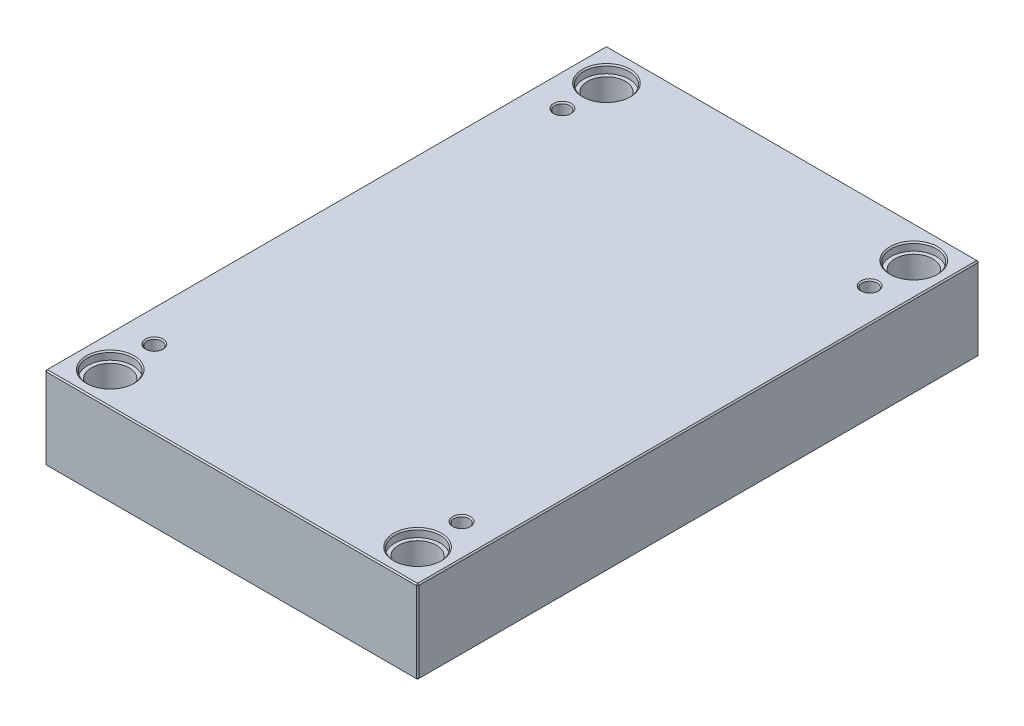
ISO-10303-21;
HEADER;
FILE_DESCRIPTION(('STEP AP214'),'2;1');
FILE_NAME('part.step','',(''),(''),'','','');
FILE_SCHEMA(('AUTOMOTIVE_DESIGN { 1 0 10303 214 1 1 1 1 }'));
ENDSEC;
DATA;
#1=APPLICATION_CONTEXT('core data for automotive mechanical design processes');
#2=APPLICATION_PROTOCOL_DEFINITION('international standard','automotive_design',2000,#1);
#3=PRODUCT_CONTEXT('',#1,'mechanical');
#4=PRODUCT('Part','Part','',(#3));
#5=PRODUCT_RELATED_PRODUCT_CATEGORY('part','',(#4));
#6=PRODUCT_DEFINITION_FORMATION('','',#4);
#7=PRODUCT_DEFINITION_CONTEXT('part definition',#1,'design');
#8=PRODUCT_DEFINITION('design','',#6,#7);
#9=PRODUCT_DEFINITION_SHAPE('','',#8);
#10=(LENGTH_UNIT() NAMED_UNIT(*) SI_UNIT(.MILLI.,.METRE.));
#11=(NAMED_UNIT(*) PLANE_ANGLE_UNIT() SI_UNIT($,.RADIAN.));
#12=(NAMED_UNIT(*) SI_UNIT($,.STERADIAN.) SOLID_ANGLE_UNIT());
#13=UNCERTAINTY_MEASURE_WITH_UNIT(LENGTH_MEASURE(1.E-05),#10,'distance_accuracy_value','');
#14=(GEOMETRIC_REPRESENTATION_CONTEXT(3) GLOBAL_UNCERTAINTY_ASSIGNED_CONTEXT((#13)) GLOBAL_UNIT_ASSIGNED_CONTEXT((#10,
#11,#12)) REPRESENTATION_CONTEXT('',''));
#15=CARTESIAN_POINT('',(0.,0.,0.));
#16=DIRECTION('',(0.,0.,1.));
#17=DIRECTION('',(1.,0.,0.));
#18=AXIS2_PLACEMENT_3D('',#15,#16,#17);
#19=CARTESIAN_POINT('',(-122.,0.,-197.));
#20=DIRECTION('',(0.,1.,0.));
#21=DIRECTION('',(0.,0.,1.));
#22=AXIS2_PLACEMENT_3D('',#19,#20,#21);
#23=CYLINDRICAL_SURFACE('',#22,15.);
#24=CARTESIAN_POINT('',(-122.,1.00000000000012,-197.));
#25=DIRECTION('',(0.,1.,0.));
#26=DIRECTION('',(0.,0.,1.));
#27=AXIS2_PLACEMENT_3D('',#24,#25,#26);
#28=CIRCLE('',#27,15.);
#29=CARTESIAN_POINT('',(-122.,1.00000000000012,-182.));
#30=VERTEX_POINT('',#29);
#31=EDGE_CURVE('E472',#30,#30,#28,.F.);
#32=ORIENTED_EDGE('',*,*,#31,.T.);
#33=EDGE_LOOP('',(#32));
#34=FACE_BOUND('',#33,.T.);
#35=CARTESIAN_POINT('',(-122.,59.7,-197.));
#36=DIRECTION('',(0.,1.,0.));
#37=DIRECTION('',(0.,0.,1.));
#38=AXIS2_PLACEMENT_3D('',#35,#36,#37);
#39=CIRCLE('',#38,15.);
#40=CARTESIAN_POINT('',(-122.,59.7,-182.));
#41=VERTEX_POINT('',#40);
#42=EDGE_CURVE('E221',#41,#41,#39,.F.);
#43=ORIENTED_EDGE('',*,*,#42,.F.);
#44=EDGE_LOOP('',(#43));
#45=FACE_BOUND('',#44,.T.);
#46=ADVANCED_FACE('F16',(#34,#45),#23,.F.);
#47=CARTESIAN_POINT('',(122.,0.,-197.));
#48=DIRECTION('',(0.,1.,0.));
#49=DIRECTION('',(0.,0.,1.));
#50=AXIS2_PLACEMENT_3D('',#47,#48,#49);
#51=CYLINDRICAL_SURFACE('',#50,15.);
#52=CARTESIAN_POINT('',(122.,1.,-197.));
#53=DIRECTION('',(0.,1.,0.));
#54=DIRECTION('',(0.,0.,1.));
#55=AXIS2_PLACEMENT_3D('',#52,#53,#54);
#56=CIRCLE('',#55,15.);
#57=CARTESIAN_POINT('',(122.,1.,-182.));
#58=VERTEX_POINT('',#57);
#59=EDGE_CURVE('E474',#58,#58,#56,.F.);
#60=ORIENTED_EDGE('',*,*,#59,.T.);
#61=EDGE_LOOP('',(#60));
#62=FACE_BOUND('',#61,.T.);
#63=CARTESIAN_POINT('',(122.,59.7,-197.));
#64=DIRECTION('',(0.,1.,0.));
#65=DIRECTION('',(0.,0.,1.));
#66=AXIS2_PLACEMENT_3D('',#63,#64,#65);
#67=CIRCLE('',#66,15.);
#68=CARTESIAN_POINT('',(122.,59.7,-182.));
#69=VERTEX_POINT('',#68);
#70=EDGE_CURVE('E218',#69,#69,#67,.F.);
#71=ORIENTED_EDGE('',*,*,#70,.F.);
#72=EDGE_LOOP('',(#71));
#73=FACE_BOUND('',#72,.T.);
#74=ADVANCED_FACE('F263',(#62,#73),#51,.F.);
#75=CARTESIAN_POINT('',(122.,0.,197.));
#76=DIRECTION('',(0.,1.,0.));
#77=DIRECTION('',(0.,0.,1.));
#78=AXIS2_PLACEMENT_3D('',#75,#76,#77);
#79=CYLINDRICAL_SURFACE('',#78,15.);
#80=CARTESIAN_POINT('',(122.,1.,197.));
#81=DIRECTION('',(0.,1.,0.));
#82=DIRECTION('',(0.,0.,1.));
#83=AXIS2_PLACEMENT_3D('',#80,#81,#82);
#84=CIRCLE('',#83,15.);
#85=CARTESIAN_POINT('',(122.,1.,212.));
#86=VERTEX_POINT('',#85);
#87=EDGE_CURVE('E477',#86,#86,#84,.F.);
#88=ORIENTED_EDGE('',*,*,#87,.T.);
#89=EDGE_LOOP('',(#88));
#90=FACE_BOUND('',#89,.T.);
#91=CARTESIAN_POINT('',(122.,59.7,197.));
#92=DIRECTION('',(0.,1.,0.));
#93=DIRECTION('',(0.,0.,1.));
#94=AXIS2_PLACEMENT_3D('',#91,#92,#93);
#95=CIRCLE('',#94,15.);
#96=CARTESIAN_POINT('',(122.,59.7,212.));
#97=VERTEX_POINT('',#96);
#98=EDGE_CURVE('E214',#97,#97,#95,.F.);
#99=ORIENTED_EDGE('',*,*,#98,.F.);
#100=EDGE_LOOP('',(#99));
#101=FACE_BOUND('',#100,.T.);
#102=ADVANCED_FACE('F270',(#90,#101),#79,.F.);
#103=CARTESIAN_POINT('',(-122.,0.,197.));
#104=DIRECTION('',(0.,1.,0.));
#105=DIRECTION('',(0.,0.,1.));
#106=AXIS2_PLACEMENT_3D('',#103,#104,#105);
#107=CYLINDRICAL_SURFACE('',#106,15.);
#108=CARTESIAN_POINT('',(-122.,1.00000000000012,197.));
#109=DIRECTION('',(0.,1.,0.));
#110=DIRECTION('',(0.,0.,1.));
#111=AXIS2_PLACEMENT_3D('',#108,#109,#110);
#112=CIRCLE('',#111,15.);
#113=CARTESIAN_POINT('',(-122.,1.00000000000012,212.));
#114=VERTEX_POINT('',#113);
#115=EDGE_CURVE('E480',#114,#114,#112,.F.);
#116=ORIENTED_EDGE('',*,*,#115,.T.);
#117=EDGE_LOOP('',(#116));
#118=FACE_BOUND('',#117,.T.);
#119=CARTESIAN_POINT('',(-122.,59.7,197.));
#120=DIRECTION('',(0.,1.,0.));
#121=DIRECTION('',(0.,0.,1.));
#122=AXIS2_PLACEMENT_3D('',#119,#120,#121);
#123=CIRCLE('',#122,15.);
#124=CARTESIAN_POINT('',(-122.,59.7,212.));
#125=VERTEX_POINT('',#124);
#126=EDGE_CURVE('E211',#125,#125,#123,.F.);
#127=ORIENTED_EDGE('',*,*,#126,.F.);
#128=EDGE_LOOP('',(#127));
#129=FACE_BOUND('',#128,.T.);
#130=ADVANCED_FACE('F277',(#118,#129),#107,.F.);
#131=CARTESIAN_POINT('',(-148.,66.,223.));
#132=DIRECTION('',(1.,0.,0.));
#133=DIRECTION('',(0.,0.,-1.));
#134=AXIS2_PLACEMENT_3D('',#131,#132,#133);
#135=PLANE('',#134);
#136=DIRECTION('',(0.,-1.,0.));
#137=VECTOR('',#136,1.);
#138=CARTESIAN_POINT('',(-148.,66.,-222.));
#139=LINE('',#138,#137);
#140=CARTESIAN_POINT('',(-148.,65.,-222.));
#141=VERTEX_POINT('',#140);
#142=CARTESIAN_POINT('',(-148.,1.,-222.));
#143=VERTEX_POINT('',#142);
#144=EDGE_CURVE('E487',#141,#143,#139,.T.);
#145=ORIENTED_EDGE('',*,*,#144,.T.);
#146=DIRECTION('',(0.,0.,1.));
#147=VECTOR('',#146,1.);
#148=CARTESIAN_POINT('',(-148.,1.,223.));
#149=LINE('',#148,#147);
#150=CARTESIAN_POINT('',(-148.,1.,222.));
#151=VERTEX_POINT('',#150);
#152=EDGE_CURVE('E490',#143,#151,#149,.T.);
#153=ORIENTED_EDGE('',*,*,#152,.T.);
#154=DIRECTION('',(0.,1.,0.));
#155=VECTOR('',#154,1.);
#156=CARTESIAN_POINT('',(-148.,66.,222.));
#157=LINE('',#156,#155);
#158=CARTESIAN_POINT('',(-148.,65.,222.));
#159=VERTEX_POINT('',#158);
#160=EDGE_CURVE('E485',#151,#159,#157,.T.);
#161=ORIENTED_EDGE('',*,*,#160,.T.);
#162=DIRECTION('',(0.,0.,-1.));
#163=VECTOR('',#162,1.);
#164=CARTESIAN_POINT('',(-148.,65.,-223.));
#165=LINE('',#164,#163);
#166=EDGE_CURVE('E483',#159,#141,#165,.T.);
#167=ORIENTED_EDGE('',*,*,#166,.T.);
#168=EDGE_LOOP('',(#145,#153,#161,#167));
#169=FACE_BOUND('',#168,.T.);
#170=ADVANCED_FACE('F298',(#169),#135,.F.);
#171=CARTESIAN_POINT('',(148.,66.,223.));
#172=DIRECTION('',(0.,0.,-1.));
#173=DIRECTION('',(-1.,0.,0.));
#174=AXIS2_PLACEMENT_3D('',#171,#172,#173);
#175=PLANE('',#174);
#176=DIRECTION('',(-1.,0.,0.));
#177=VECTOR('',#176,1.);
#178=CARTESIAN_POINT('',(-148.,65.,223.));
#179=LINE('',#178,#177);
#180=CARTESIAN_POINT('',(147.,65.,223.));
#181=VERTEX_POINT('',#180);
#182=CARTESIAN_POINT('',(-147.,65.,223.));
#183=VERTEX_POINT('',#182);
#184=EDGE_CURVE('E509',#181,#183,#179,.T.);
#185=ORIENTED_EDGE('',*,*,#184,.T.);
#186=DIRECTION('',(0.,-1.,0.));
#187=VECTOR('',#186,1.);
#188=CARTESIAN_POINT('',(-147.,66.,223.));
#189=LINE('',#188,#187);
#190=CARTESIAN_POINT('',(-147.,0.999999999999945,223.));
#191=VERTEX_POINT('',#190);
#192=EDGE_CURVE('E515',#183,#191,#189,.T.);
#193=ORIENTED_EDGE('',*,*,#192,.T.);
#194=DIRECTION('',(1.,0.,0.));
#195=VECTOR('',#194,1.);
#196=CARTESIAN_POINT('',(148.,0.999999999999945,223.));
#197=LINE('',#196,#195);
#198=CARTESIAN_POINT('',(147.,0.999999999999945,223.));
#199=VERTEX_POINT('',#198);
#200=EDGE_CURVE('E513',#191,#199,#197,.T.);
#201=ORIENTED_EDGE('',*,*,#200,.T.);
#202=DIRECTION('',(0.,1.,0.));
#203=VECTOR('',#202,1.);
#204=CARTESIAN_POINT('',(147.,66.,223.));
#205=LINE('',#204,#203);
#206=EDGE_CURVE('E511',#199,#181,#205,.T.);
#207=ORIENTED_EDGE('',*,*,#206,.T.);
#208=EDGE_LOOP('',(#185,#193,#201,#207));
#209=FACE_BOUND('',#208,.T.);
#210=ADVANCED_FACE('F294',(#209),#175,.F.);
#211=CARTESIAN_POINT('',(148.,66.,223.));
#212=DIRECTION('',(-1.,0.,0.));
#213=DIRECTION('',(0.,0.,1.));
#214=AXIS2_PLACEMENT_3D('',#211,#212,#213);
#215=PLANE('',#214);
#216=DIRECTION('',(0.,0.,-1.));
#217=VECTOR('',#216,1.);
#218=CARTESIAN_POINT('',(148.,0.999999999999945,223.));
#219=LINE('',#218,#217);
#220=CARTESIAN_POINT('',(148.,0.999999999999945,222.));
#221=VERTEX_POINT('',#220);
#222=CARTESIAN_POINT('',(148.,0.999999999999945,-222.));
#223=VERTEX_POINT('',#222);
#224=EDGE_CURVE('E504',#221,#223,#219,.T.);
#225=ORIENTED_EDGE('',*,*,#224,.T.);
#226=DIRECTION('',(0.,1.,0.));
#227=VECTOR('',#226,1.);
#228=CARTESIAN_POINT('',(148.,66.,-222.));
#229=LINE('',#228,#227);
#230=CARTESIAN_POINT('',(148.,65.,-222.));
#231=VERTEX_POINT('',#230);
#232=EDGE_CURVE('E506',#223,#231,#229,.T.);
#233=ORIENTED_EDGE('',*,*,#232,.T.);
#234=DIRECTION('',(0.,0.,1.));
#235=VECTOR('',#234,1.);
#236=CARTESIAN_POINT('',(148.,65.,223.));
#237=LINE('',#236,#235);
#238=CARTESIAN_POINT('',(148.,65.,222.));
#239=VERTEX_POINT('',#238);
#240=EDGE_CURVE('E500',#231,#239,#237,.T.);
#241=ORIENTED_EDGE('',*,*,#240,.T.);
#242=DIRECTION('',(0.,-1.,0.));
#243=VECTOR('',#242,1.);
#244=CARTESIAN_POINT('',(148.,66.,222.));
#245=LINE('',#244,#243);
#246=EDGE_CURVE('E502',#239,#221,#245,.T.);
#247=ORIENTED_EDGE('',*,*,#246,.T.);
#248=EDGE_LOOP('',(#225,#233,#241,#247));
#249=FACE_BOUND('',#248,.T.);
#250=ADVANCED_FACE('F290',(#249),#215,.F.);
#251=CARTESIAN_POINT('',(148.,66.,-223.));
#252=DIRECTION('',(0.,0.,1.));
#253=DIRECTION('',(1.,0.,0.));
#254=AXIS2_PLACEMENT_3D('',#251,#252,#253);
#255=PLANE('',#254);
#256=DIRECTION('',(0.,-1.,0.));
#257=VECTOR('',#256,1.);
#258=CARTESIAN_POINT('',(147.,66.,-223.));
#259=LINE('',#258,#257);
#260=CARTESIAN_POINT('',(147.,65.,-223.));
#261=VERTEX_POINT('',#260);
#262=CARTESIAN_POINT('',(147.,0.999999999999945,-223.));
#263=VERTEX_POINT('',#262);
#264=EDGE_CURVE('E494',#261,#263,#259,.T.);
#265=ORIENTED_EDGE('',*,*,#264,.T.);
#266=DIRECTION('',(-1.,0.,0.));
#267=VECTOR('',#266,1.);
#268=CARTESIAN_POINT('',(148.,0.999999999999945,-223.));
#269=LINE('',#268,#267);
#270=CARTESIAN_POINT('',(-147.,0.999999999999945,-223.));
#271=VERTEX_POINT('',#270);
#272=EDGE_CURVE('E138',#263,#271,#269,.T.);
#273=ORIENTED_EDGE('',*,*,#272,.T.);
#274=DIRECTION('',(0.,1.,0.));
#275=VECTOR('',#274,1.);
#276=CARTESIAN_POINT('',(-147.,66.,-223.));
#277=LINE('',#276,#275);
#278=CARTESIAN_POINT('',(-147.,65.,-223.));
#279=VERTEX_POINT('',#278);
#280=EDGE_CURVE('E496',#271,#279,#277,.T.);
#281=ORIENTED_EDGE('',*,*,#280,.T.);
#282=DIRECTION('',(1.,0.,0.));
#283=VECTOR('',#282,1.);
#284=CARTESIAN_POINT('',(148.,65.,-223.));
#285=LINE('',#284,#283);
#286=EDGE_CURVE('E492',#279,#261,#285,.T.);
#287=ORIENTED_EDGE('',*,*,#286,.T.);
#288=EDGE_LOOP('',(#265,#273,#281,#287));
#289=FACE_BOUND('',#288,.T.);
#290=ADVANCED_FACE('F282',(#289),#255,.F.);
#291=CARTESIAN_POINT('',(0.,66.,0.));
#292=DIRECTION('',(0.,1.,0.));
#293=DIRECTION('',(0.,0.,1.));
#294=AXIS2_PLACEMENT_3D('',#291,#292,#293);
#295=PLANE('',#294);
#296=CARTESIAN_POINT('',(122.,66.,197.));
#297=DIRECTION('',(0.,1.,0.));
#298=DIRECTION('',(0.,0.,1.));
#299=AXIS2_PLACEMENT_3D('',#296,#297,#298);
#300=CIRCLE('',#299,19.);
#301=CARTESIAN_POINT('',(122.,66.,216.));
#302=VERTEX_POINT('',#301);
#303=EDGE_CURVE('E236',#302,#302,#300,.F.);
#304=ORIENTED_EDGE('',*,*,#303,.T.);
#305=EDGE_LOOP('',(#304));
#306=FACE_BOUND('',#305,.T.);
#307=CARTESIAN_POINT('',(-122.,66.,197.));
#308=DIRECTION('',(0.,1.,0.));
#309=DIRECTION('',(0.,0.,1.));
#310=AXIS2_PLACEMENT_3D('',#307,#308,#309);
#311=CIRCLE('',#310,19.);
#312=CARTESIAN_POINT('',(-122.,66.,216.));
#313=VERTEX_POINT('',#312);
#314=EDGE_CURVE('E233',#313,#313,#311,.F.);
#315=ORIENTED_EDGE('',*,*,#314,.T.);
#316=EDGE_LOOP('',(#315));
#317=FACE_BOUND('',#316,.T.);
#318=CARTESIAN_POINT('',(122.,66.,-197.));
#319=DIRECTION('',(0.,1.,0.));
#320=DIRECTION('',(0.,0.,1.));
#321=AXIS2_PLACEMENT_3D('',#318,#319,#320);
#322=CIRCLE('',#321,19.);
#323=CARTESIAN_POINT('',(122.,66.,-178.));
#324=VERTEX_POINT('',#323);
#325=EDGE_CURVE('E230',#324,#324,#322,.F.);
#326=ORIENTED_EDGE('',*,*,#325,.T.);
#327=EDGE_LOOP('',(#326));
#328=FACE_BOUND('',#327,.T.);
#329=CARTESIAN_POINT('',(-122.,66.,-197.));
#330=DIRECTION('',(0.,1.,0.));
#331=DIRECTION('',(0.,0.,1.));
#332=AXIS2_PLACEMENT_3D('',#329,#330,#331);
#333=CIRCLE('',#332,19.);
#334=CARTESIAN_POINT('',(-122.,66.,-178.));
#335=VERTEX_POINT('',#334);
#336=EDGE_CURVE('E227',#335,#335,#333,.F.);
#337=ORIENTED_EDGE('',*,*,#336,.T.);
#338=EDGE_LOOP('',(#337));
#339=FACE_BOUND('',#338,.T.);
#340=CARTESIAN_POINT('',(-122.,66.,162.));
#341=DIRECTION('',(0.,1.,0.));
#342=DIRECTION('',(0.,0.,1.));
#343=AXIS2_PLACEMENT_3D('',#340,#341,#342);
#344=CIRCLE('',#343,7.);
#345=CARTESIAN_POINT('',(-122.,66.,169.));
#346=VERTEX_POINT('',#345);
#347=EDGE_CURVE('E198',#346,#346,#344,.F.);
#348=ORIENTED_EDGE('',*,*,#347,.T.);
#349=EDGE_LOOP('',(#348));
#350=FACE_BOUND('',#349,.T.);
#351=CARTESIAN_POINT('',(122.,66.,162.));
#352=DIRECTION('',(0.,1.,0.));
#353=DIRECTION('',(0.,0.,1.));
#354=AXIS2_PLACEMENT_3D('',#351,#352,#353);
#355=CIRCLE('',#354,7.);
#356=CARTESIAN_POINT('',(122.,66.,169.));
#357=VERTEX_POINT('',#356);
#358=EDGE_CURVE('E195',#357,#357,#355,.F.);
#359=ORIENTED_EDGE('',*,*,#358,.T.);
#360=EDGE_LOOP('',(#359));
#361=FACE_BOUND('',#360,.T.);
#362=CARTESIAN_POINT('',(122.,66.,-162.));
#363=DIRECTION('',(0.,1.,0.));
#364=DIRECTION('',(0.,0.,1.));
#365=AXIS2_PLACEMENT_3D('',#362,#363,#364);
#366=CIRCLE('',#365,7.);
#367=CARTESIAN_POINT('',(122.,66.,-155.));
#368=VERTEX_POINT('',#367);
#369=EDGE_CURVE('E192',#368,#368,#366,.F.);
#370=ORIENTED_EDGE('',*,*,#369,.T.);
#371=EDGE_LOOP('',(#370));
#372=FACE_BOUND('',#371,.T.);
#373=CARTESIAN_POINT('',(-122.,66.,-162.));
#374=DIRECTION('',(0.,1.,0.));
#375=DIRECTION('',(0.,0.,1.));
#376=AXIS2_PLACEMENT_3D('',#373,#374,#375);
#377=CIRCLE('',#376,7.);
#378=CARTESIAN_POINT('',(-122.,66.,-155.));
#379=VERTEX_POINT('',#378);
#380=EDGE_CURVE('E188',#379,#379,#377,.F.);
#381=ORIENTED_EDGE('',*,*,#380,.T.);
#382=EDGE_LOOP('',(#381));
#383=FACE_BOUND('',#382,.T.);
#384=DIRECTION('',(0.,0.,-1.));
#385=VECTOR('',#384,1.);
#386=CARTESIAN_POINT('',(147.,66.,-223.));
#387=LINE('',#386,#385);
#388=CARTESIAN_POINT('',(147.,66.,222.));
#389=VERTEX_POINT('',#388);
#390=CARTESIAN_POINT('',(147.,66.,-222.));
#391=VERTEX_POINT('',#390);
#392=EDGE_CURVE('E31',#389,#391,#387,.T.);
#393=ORIENTED_EDGE('',*,*,#392,.T.);
#394=DIRECTION('',(-1.,0.,0.));
#395=VECTOR('',#394,1.);
#396=CARTESIAN_POINT('',(-148.,66.,-222.));
#397=LINE('',#396,#395);
#398=CARTESIAN_POINT('',(-147.,66.,-222.));
#399=VERTEX_POINT('',#398);
#400=EDGE_CURVE('E189',#391,#399,#397,.T.);
#401=ORIENTED_EDGE('',*,*,#400,.T.);
#402=DIRECTION('',(0.,0.,1.));
#403=VECTOR('',#402,1.);
#404=CARTESIAN_POINT('',(-147.,66.,223.));
#405=LINE('',#404,#403);
#406=CARTESIAN_POINT('',(-147.,66.,222.));
#407=VERTEX_POINT('',#406);
#408=EDGE_CURVE('E518',#399,#407,#405,.T.);
#409=ORIENTED_EDGE('',*,*,#408,.T.);
#410=DIRECTION('',(1.,0.,0.));
#411=VECTOR('',#410,1.);
#412=CARTESIAN_POINT('',(148.,66.,222.));
#413=LINE('',#412,#411);
#414=EDGE_CURVE('E36',#407,#389,#413,.T.);
#415=ORIENTED_EDGE('',*,*,#414,.T.);
#416=EDGE_LOOP('',(#393,#401,#409,#415));
#417=FACE_BOUND('',#416,.T.);
#418=ADVANCED_FACE('F279',(#306,#317,#328,#339,#350,#361,#372,#383,#417),#295,.T.);
#419=CARTESIAN_POINT('',(0.,0.,0.));
#420=DIRECTION('',(0.,1.,0.));
#421=DIRECTION('',(0.,0.,1.));
#422=AXIS2_PLACEMENT_3D('',#419,#420,#421);
#423=PLANE('',#422);
#424=CARTESIAN_POINT('',(-122.,0.,-197.));
#425=DIRECTION('',(0.,1.,0.));
#426=DIRECTION('',(0.,0.,1.));
#427=AXIS2_PLACEMENT_3D('',#424,#425,#426);
#428=CIRCLE('',#427,16.);
#429=CARTESIAN_POINT('',(-122.,0.,-181.));
#430=VERTEX_POINT('',#429);
#431=EDGE_CURVE('E469',#430,#430,#428,.T.);
#432=ORIENTED_EDGE('',*,*,#431,.T.);
#433=EDGE_LOOP('',(#432));
#434=FACE_BOUND('',#433,.T.);
#435=CARTESIAN_POINT('',(122.,0.,-197.));
#436=DIRECTION('',(0.,1.,0.));
#437=DIRECTION('',(0.,0.,1.));
#438=AXIS2_PLACEMENT_3D('',#435,#436,#437);
#439=CIRCLE('',#438,16.);
#440=CARTESIAN_POINT('',(122.,0.,-181.));
#441=VERTEX_POINT('',#440);
#442=EDGE_CURVE('E466',#441,#441,#439,.T.);
#443=ORIENTED_EDGE('',*,*,#442,.T.);
#444=EDGE_LOOP('',(#443));
#445=FACE_BOUND('',#444,.T.);
#446=CARTESIAN_POINT('',(122.,0.,197.));
#447=DIRECTION('',(0.,1.,0.));
#448=DIRECTION('',(0.,0.,1.));
#449=AXIS2_PLACEMENT_3D('',#446,#447,#448);
#450=CIRCLE('',#449,16.);
#451=CARTESIAN_POINT('',(122.,0.,213.));
#452=VERTEX_POINT('',#451);
#453=EDGE_CURVE('E463',#452,#452,#450,.T.);
#454=ORIENTED_EDGE('',*,*,#453,.T.);
#455=EDGE_LOOP('',(#454));
#456=FACE_BOUND('',#455,.T.);
#457=CARTESIAN_POINT('',(-122.,0.,197.));
#458=DIRECTION('',(0.,1.,0.));
#459=DIRECTION('',(0.,0.,1.));
#460=AXIS2_PLACEMENT_3D('',#457,#458,#459);
#461=CIRCLE('',#460,16.);
#462=CARTESIAN_POINT('',(-122.,0.,213.));
#463=VERTEX_POINT('',#462);
#464=EDGE_CURVE('E460',#463,#463,#461,.T.);
#465=ORIENTED_EDGE('',*,*,#464,.T.);
#466=EDGE_LOOP('',(#465));
#467=FACE_BOUND('',#466,.T.);
#468=DIRECTION('',(0.,0.,1.));
#469=VECTOR('',#468,1.);
#470=CARTESIAN_POINT('',(147.,0.,0.));
#471=LINE('',#470,#469);
#472=CARTESIAN_POINT('',(147.,0.,-222.));
#473=VERTEX_POINT('',#472);
#474=CARTESIAN_POINT('',(147.,0.,222.));
#475=VERTEX_POINT('',#474);
#476=EDGE_CURVE('E108',#473,#475,#471,.T.);
#477=ORIENTED_EDGE('',*,*,#476,.T.);
#478=DIRECTION('',(-1.,0.,0.));
#479=VECTOR('',#478,1.);
#480=CARTESIAN_POINT('',(0.,0.,222.));
#481=LINE('',#480,#479);
#482=CARTESIAN_POINT('',(-147.,0.,222.));
#483=VERTEX_POINT('',#482);
#484=EDGE_CURVE('E458',#475,#483,#481,.T.);
#485=ORIENTED_EDGE('',*,*,#484,.T.);
#486=DIRECTION('',(0.,0.,-1.));
#487=VECTOR('',#486,1.);
#488=CARTESIAN_POINT('',(-147.,0.,0.));
#489=LINE('',#488,#487);
#490=CARTESIAN_POINT('',(-147.,0.,-222.));
#491=VERTEX_POINT('',#490);
#492=EDGE_CURVE('E110',#483,#491,#489,.T.);
#493=ORIENTED_EDGE('',*,*,#492,.T.);
#494=DIRECTION('',(1.,0.,0.));
#495=VECTOR('',#494,1.);
#496=CARTESIAN_POINT('',(0.,0.,-222.));
#497=LINE('',#496,#495);
#498=EDGE_CURVE('E104',#491,#473,#497,.T.);
#499=ORIENTED_EDGE('',*,*,#498,.T.);
#500=EDGE_LOOP('',(#477,#485,#493,#499));
#501=FACE_BOUND('',#500,.T.);
#502=ADVANCED_FACE('F106',(#434,#445,#456,#467,#501),#423,.F.);
#503=CARTESIAN_POINT('',(-122.,0.,-197.));
#504=DIRECTION('',(0.,-1.,0.));
#505=DIRECTION('',(0.,0.,-1.));
#506=AXIS2_PLACEMENT_3D('',#503,#504,#505);
#507=CONICAL_SURFACE('',#506,16.,0.78539816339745);
#508=ORIENTED_EDGE('',*,*,#31,.F.);
#509=EDGE_LOOP('',(#508));
#510=FACE_BOUND('',#509,.T.);
#511=ORIENTED_EDGE('',*,*,#431,.F.);
#512=EDGE_LOOP('',(#511));
#513=FACE_BOUND('',#512,.T.);
#514=ADVANCED_FACE('F286',(#510,#513),#507,.F.);
#515=CARTESIAN_POINT('',(122.,0.,-197.));
#516=DIRECTION('',(0.,-1.,0.));
#517=DIRECTION('',(0.,0.,-1.));
#518=AXIS2_PLACEMENT_3D('',#515,#516,#517);
#519=CONICAL_SURFACE('',#518,16.,0.785398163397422);
#520=ORIENTED_EDGE('',*,*,#59,.F.);
#521=EDGE_LOOP('',(#520));
#522=FACE_BOUND('',#521,.T.);
#523=ORIENTED_EDGE('',*,*,#442,.F.);
#524=EDGE_LOOP('',(#523));
#525=FACE_BOUND('',#524,.T.);
#526=ADVANCED_FACE('F305',(#522,#525),#519,.F.);
#527=CARTESIAN_POINT('',(122.,0.,197.));
#528=DIRECTION('',(0.,-1.,0.));
#529=DIRECTION('',(0.,0.,-1.));
#530=AXIS2_PLACEMENT_3D('',#527,#528,#529);
#531=CONICAL_SURFACE('',#530,16.,0.785398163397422);
#532=ORIENTED_EDGE('',*,*,#87,.F.);
#533=EDGE_LOOP('',(#532));
#534=FACE_BOUND('',#533,.T.);
#535=ORIENTED_EDGE('',*,*,#453,.F.);
#536=EDGE_LOOP('',(#535));
#537=FACE_BOUND('',#536,.T.);
#538=ADVANCED_FACE('F309',(#534,#537),#531,.F.);
#539=CARTESIAN_POINT('',(-122.,0.,197.));
#540=DIRECTION('',(0.,-1.,0.));
#541=DIRECTION('',(0.,0.,-1.));
#542=AXIS2_PLACEMENT_3D('',#539,#540,#541);
#543=CONICAL_SURFACE('',#542,16.,0.78539816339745);
#544=ORIENTED_EDGE('',*,*,#115,.F.);
#545=EDGE_LOOP('',(#544));
#546=FACE_BOUND('',#545,.T.);
#547=ORIENTED_EDGE('',*,*,#464,.F.);
#548=EDGE_LOOP('',(#547));
#549=FACE_BOUND('',#548,.T.);
#550=ADVANCED_FACE('F313',(#546,#549),#543,.F.);
#551=CARTESIAN_POINT('',(148.,66.,222.));
#552=DIRECTION('',(-0.707106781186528,0.,-0.707106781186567));
#553=DIRECTION('',(0.,-1.,0.));
#554=AXIS2_PLACEMENT_3D('',#551,#552,#553);
#555=PLANE('',#554);
#556=DIRECTION('',(-0.707106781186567,0.,0.707106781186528));
#557=VECTOR('',#556,1.);
#558=CARTESIAN_POINT('',(147.,65.,223.));
#559=LINE('',#558,#557);
#560=EDGE_CURVE('E126',#181,#239,#559,.F.);
#561=ORIENTED_EDGE('',*,*,#560,.F.);
#562=ORIENTED_EDGE('',*,*,#206,.F.);
#563=DIRECTION('',(0.707106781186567,0.,-0.707106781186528));
#564=VECTOR('',#563,1.);
#565=CARTESIAN_POINT('',(147.,0.999999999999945,223.));
#566=LINE('',#565,#564);
#567=EDGE_CURVE('E180',#221,#199,#566,.F.);
#568=ORIENTED_EDGE('',*,*,#567,.F.);
#569=ORIENTED_EDGE('',*,*,#246,.F.);
#570=EDGE_LOOP('',(#561,#562,#568,#569));
#571=FACE_BOUND('',#570,.T.);
#572=ADVANCED_FACE('F317',(#571),#555,.F.);
#573=CARTESIAN_POINT('',(147.,65.,223.));
#574=DIRECTION('',(0.577350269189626,0.577350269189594,0.577350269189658));
#575=DIRECTION('',(0.707106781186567,0.,-0.707106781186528));
#576=AXIS2_PLACEMENT_3D('',#573,#574,#575);
#577=PLANE('',#576);
#578=DIRECTION('',(0.,-0.707106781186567,0.707106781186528));
#579=VECTOR('',#578,1.);
#580=CARTESIAN_POINT('',(147.,65.,223.));
#581=LINE('',#580,#579);
#582=EDGE_CURVE('E175',#181,#389,#581,.F.);
#583=ORIENTED_EDGE('',*,*,#582,.F.);
#584=ORIENTED_EDGE('',*,*,#560,.T.);
#585=DIRECTION('',(-0.707106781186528,0.707106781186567,0.));
#586=VECTOR('',#585,1.);
#587=CARTESIAN_POINT('',(147.5,65.5,222.));
#588=LINE('',#587,#586);
#589=EDGE_CURVE('E177',#389,#239,#588,.F.);
#590=ORIENTED_EDGE('',*,*,#589,.F.);
#591=EDGE_LOOP('',(#583,#584,#590));
#592=FACE_BOUND('',#591,.T.);
#593=ADVANCED_FACE('F385',(#592),#577,.T.);
#594=CARTESIAN_POINT('',(147.,0.999999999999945,223.));
#595=DIRECTION('',(0.577350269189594,-0.577350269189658,0.577350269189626));
#596=DIRECTION('',(0.,-0.707106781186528,-0.707106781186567));
#597=AXIS2_PLACEMENT_3D('',#594,#595,#596);
#598=PLANE('',#597);
#599=DIRECTION('',(-0.707106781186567,-0.707106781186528,0.));
#600=VECTOR('',#599,1.);
#601=CARTESIAN_POINT('',(147.5,0.499999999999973,222.));
#602=LINE('',#601,#600);
#603=EDGE_CURVE('E124',#221,#475,#602,.T.);
#604=ORIENTED_EDGE('',*,*,#603,.F.);
#605=ORIENTED_EDGE('',*,*,#567,.T.);
#606=DIRECTION('',(0.,0.707106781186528,0.707106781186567));
#607=VECTOR('',#606,1.);
#608=CARTESIAN_POINT('',(147.,0.999999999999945,223.));
#609=LINE('',#608,#607);
#610=EDGE_CURVE('E172',#475,#199,#609,.T.);
#611=ORIENTED_EDGE('',*,*,#610,.F.);
#612=EDGE_LOOP('',(#604,#605,#611));
#613=FACE_BOUND('',#612,.T.);
#614=ADVANCED_FACE('F381',(#613),#598,.T.);
#615=CARTESIAN_POINT('',(147.,66.,0.));
#616=DIRECTION('',(0.707106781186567,0.707106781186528,0.));
#617=DIRECTION('',(0.,0.,1.));
#618=AXIS2_PLACEMENT_3D('',#615,#616,#617);
#619=PLANE('',#618);
#620=ORIENTED_EDGE('',*,*,#589,.T.);
#621=ORIENTED_EDGE('',*,*,#240,.F.);
#622=DIRECTION('',(0.707106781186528,-0.707106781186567,0.));
#623=VECTOR('',#622,1.);
#624=CARTESIAN_POINT('',(148.,65.,-222.));
#625=LINE('',#624,#623);
#626=EDGE_CURVE('E166',#391,#231,#625,.T.);
#627=ORIENTED_EDGE('',*,*,#626,.F.);
#628=ORIENTED_EDGE('',*,*,#392,.F.);
#629=EDGE_LOOP('',(#620,#621,#627,#628));
#630=FACE_BOUND('',#629,.T.);
#631=ADVANCED_FACE('F377',(#630),#619,.T.);
#632=CARTESIAN_POINT('',(0.,66.,222.));
#633=DIRECTION('',(0.,0.707106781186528,0.707106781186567));
#634=DIRECTION('',(-1.,0.,0.));
#635=AXIS2_PLACEMENT_3D('',#632,#633,#634);
#636=PLANE('',#635);
#637=ORIENTED_EDGE('',*,*,#582,.T.);
#638=ORIENTED_EDGE('',*,*,#414,.F.);
#639=DIRECTION('',(0.,0.707106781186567,-0.707106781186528));
#640=VECTOR('',#639,1.);
#641=CARTESIAN_POINT('',(-147.,65.5,222.5));
#642=LINE('',#641,#640);
#643=EDGE_CURVE('E163',#183,#407,#642,.T.);
#644=ORIENTED_EDGE('',*,*,#643,.F.);
#645=ORIENTED_EDGE('',*,*,#184,.F.);
#646=EDGE_LOOP('',(#637,#638,#644,#645));
#647=FACE_BOUND('',#646,.T.);
#648=ADVANCED_FACE('F373',(#647),#636,.T.);
#649=CARTESIAN_POINT('',(-147.,66.,223.));
#650=DIRECTION('',(0.707106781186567,0.,-0.707106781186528));
#651=DIRECTION('',(0.,-1.,0.));
#652=AXIS2_PLACEMENT_3D('',#649,#650,#651);
#653=PLANE('',#652);
#654=DIRECTION('',(0.707106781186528,0.,0.707106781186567));
#655=VECTOR('',#654,1.);
#656=CARTESIAN_POINT('',(-147.,0.999999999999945,223.));
#657=LINE('',#656,#655);
#658=EDGE_CURVE('E157',#191,#151,#657,.F.);
#659=ORIENTED_EDGE('',*,*,#658,.F.);
#660=ORIENTED_EDGE('',*,*,#192,.F.);
#661=DIRECTION('',(-0.707106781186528,0.,-0.707106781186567));
#662=VECTOR('',#661,1.);
#663=CARTESIAN_POINT('',(-148.,65.,222.));
#664=LINE('',#663,#662);
#665=EDGE_CURVE('E160',#159,#183,#664,.F.);
#666=ORIENTED_EDGE('',*,*,#665,.F.);
#667=ORIENTED_EDGE('',*,*,#160,.F.);
#668=EDGE_LOOP('',(#659,#660,#666,#667));
#669=FACE_BOUND('',#668,.T.);
#670=ADVANCED_FACE('F369',(#669),#653,.F.);
#671=CARTESIAN_POINT('',(148.,0.999999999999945,223.));
#672=DIRECTION('',(0.,0.707106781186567,-0.707106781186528));
#673=DIRECTION('',(1.,0.,0.));
#674=AXIS2_PLACEMENT_3D('',#671,#672,#673);
#675=PLANE('',#674);
#676=ORIENTED_EDGE('',*,*,#610,.T.);
#677=ORIENTED_EDGE('',*,*,#200,.F.);
#678=DIRECTION('',(0.,-0.707106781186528,-0.707106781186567));
#679=VECTOR('',#678,1.);
#680=CARTESIAN_POINT('',(-147.,0.999999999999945,223.));
#681=LINE('',#680,#679);
#682=EDGE_CURVE('E135',#483,#191,#681,.F.);
#683=ORIENTED_EDGE('',*,*,#682,.F.);
#684=ORIENTED_EDGE('',*,*,#484,.F.);
#685=EDGE_LOOP('',(#676,#677,#683,#684));
#686=FACE_BOUND('',#685,.T.);
#687=ADVANCED_FACE('F366',(#686),#675,.F.);
#688=CARTESIAN_POINT('',(148.,0.999999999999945,223.));
#689=DIRECTION('',(-0.707106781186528,0.707106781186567,0.));
#690=DIRECTION('',(0.,0.,-1.));
#691=AXIS2_PLACEMENT_3D('',#688,#689,#690);
#692=PLANE('',#691);
#693=ORIENTED_EDGE('',*,*,#603,.T.);
#694=ORIENTED_EDGE('',*,*,#476,.F.);
#695=DIRECTION('',(0.707106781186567,0.707106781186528,0.));
#696=VECTOR('',#695,1.);
#697=CARTESIAN_POINT('',(147.5,0.499999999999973,-222.));
#698=LINE('',#697,#696);
#699=EDGE_CURVE('E121',#223,#473,#698,.F.);
#700=ORIENTED_EDGE('',*,*,#699,.F.);
#701=ORIENTED_EDGE('',*,*,#224,.F.);
#702=EDGE_LOOP('',(#693,#694,#700,#701));
#703=FACE_BOUND('',#702,.T.);
#704=ADVANCED_FACE('F119',(#703),#692,.F.);
#705=CARTESIAN_POINT('',(147.,66.,-223.));
#706=DIRECTION('',(-0.707106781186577,0.,0.707106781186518));
#707=DIRECTION('',(0.,-1.,0.));
#708=AXIS2_PLACEMENT_3D('',#705,#706,#707);
#709=PLANE('',#708);
#710=DIRECTION('',(0.707106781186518,0.,0.707106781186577));
#711=VECTOR('',#710,1.);
#712=CARTESIAN_POINT('',(148.,65.,-222.));
#713=LINE('',#712,#711);
#714=EDGE_CURVE('E168',#231,#261,#713,.F.);
#715=ORIENTED_EDGE('',*,*,#714,.F.);
#716=ORIENTED_EDGE('',*,*,#232,.F.);
#717=DIRECTION('',(-0.707106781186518,0.,-0.707106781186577));
#718=VECTOR('',#717,1.);
#719=CARTESIAN_POINT('',(147.,0.999999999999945,-223.));
#720=LINE('',#719,#718);
#721=EDGE_CURVE('E134',#263,#223,#720,.F.);
#722=ORIENTED_EDGE('',*,*,#721,.F.);
#723=ORIENTED_EDGE('',*,*,#264,.F.);
#724=EDGE_LOOP('',(#715,#716,#722,#723));
#725=FACE_BOUND('',#724,.T.);
#726=ADVANCED_FACE('F359',(#725),#709,.F.);
#727=CARTESIAN_POINT('',(148.,65.,-222.));
#728=DIRECTION('',(0.577350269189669,0.577350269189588,-0.57735026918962));
#729=DIRECTION('',(-0.707106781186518,0.,-0.707106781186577));
#730=AXIS2_PLACEMENT_3D('',#727,#728,#729);
#731=PLANE('',#730);
#732=ORIENTED_EDGE('',*,*,#626,.T.);
#733=ORIENTED_EDGE('',*,*,#714,.T.);
#734=DIRECTION('',(0.,0.707106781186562,0.707106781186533));
#735=VECTOR('',#734,1.);
#736=CARTESIAN_POINT('',(147.,65.5,-222.5));
#737=LINE('',#736,#735);
#738=EDGE_CURVE('E152',#391,#261,#737,.F.);
#739=ORIENTED_EDGE('',*,*,#738,.F.);
#740=EDGE_LOOP('',(#732,#733,#739));
#741=FACE_BOUND('',#740,.T.);
#742=ADVANCED_FACE('F355',(#741),#731,.T.);
#743=CARTESIAN_POINT('',(-148.,65.,222.));
#744=DIRECTION('',(-0.577350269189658,0.577350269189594,0.577350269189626));
#745=DIRECTION('',(0.707106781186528,0.,0.707106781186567));
#746=AXIS2_PLACEMENT_3D('',#743,#744,#745);
#747=PLANE('',#746);
#748=ORIENTED_EDGE('',*,*,#665,.T.);
#749=ORIENTED_EDGE('',*,*,#643,.T.);
#750=DIRECTION('',(-0.707106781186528,-0.707106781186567,0.));
#751=VECTOR('',#750,1.);
#752=CARTESIAN_POINT('',(-148.,65.,222.));
#753=LINE('',#752,#751);
#754=EDGE_CURVE('E143',#159,#407,#753,.F.);
#755=ORIENTED_EDGE('',*,*,#754,.F.);
#756=EDGE_LOOP('',(#748,#749,#755));
#757=FACE_BOUND('',#756,.T.);
#758=ADVANCED_FACE('F351',(#757),#747,.T.);
#759=CARTESIAN_POINT('',(-147.,0.999999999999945,223.));
#760=DIRECTION('',(-0.577350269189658,-0.577350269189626,0.577350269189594));
#761=DIRECTION('',(0.707106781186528,-0.707106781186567,0.));
#762=AXIS2_PLACEMENT_3D('',#759,#760,#761);
#763=PLANE('',#762);
#764=ORIENTED_EDGE('',*,*,#682,.T.);
#765=ORIENTED_EDGE('',*,*,#658,.T.);
#766=DIRECTION('',(-0.707106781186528,0.707106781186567,0.));
#767=VECTOR('',#766,1.);
#768=CARTESIAN_POINT('',(-147.5,0.5,222.));
#769=LINE('',#768,#767);
#770=EDGE_CURVE('E139',#483,#151,#769,.T.);
#771=ORIENTED_EDGE('',*,*,#770,.F.);
#772=EDGE_LOOP('',(#764,#765,#771));
#773=FACE_BOUND('',#772,.T.);
#774=ADVANCED_FACE('F348',(#773),#763,.T.);
#775=CARTESIAN_POINT('',(147.,0.999999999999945,-223.));
#776=DIRECTION('',(0.577350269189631,-0.577350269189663,-0.577350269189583));
#777=DIRECTION('',(0.707106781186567,0.707106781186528,0.));
#778=AXIS2_PLACEMENT_3D('',#775,#776,#777);
#779=PLANE('',#778);
#780=ORIENTED_EDGE('',*,*,#721,.T.);
#781=ORIENTED_EDGE('',*,*,#699,.T.);
#782=DIRECTION('',(0.,-0.707106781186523,0.707106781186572));
#783=VECTOR('',#782,1.);
#784=CARTESIAN_POINT('',(147.,0.999999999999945,-223.));
#785=LINE('',#784,#783);
#786=EDGE_CURVE('E131',#263,#473,#785,.T.);
#787=ORIENTED_EDGE('',*,*,#786,.F.);
#788=EDGE_LOOP('',(#780,#781,#787));
#789=FACE_BOUND('',#788,.T.);
#790=ADVANCED_FACE('F130',(#789),#779,.T.);
#791=CARTESIAN_POINT('',(0.,66.,-222.));
#792=DIRECTION('',(0.,0.707106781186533,-0.707106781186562));
#793=DIRECTION('',(1.,0.,0.));
#794=AXIS2_PLACEMENT_3D('',#791,#792,#793);
#795=PLANE('',#794);
#796=ORIENTED_EDGE('',*,*,#738,.T.);
#797=ORIENTED_EDGE('',*,*,#286,.F.);
#798=DIRECTION('',(0.,-0.707106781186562,-0.707106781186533));
#799=VECTOR('',#798,1.);
#800=CARTESIAN_POINT('',(-147.,65.,-223.));
#801=LINE('',#800,#799);
#802=EDGE_CURVE('E140',#399,#279,#801,.T.);
#803=ORIENTED_EDGE('',*,*,#802,.F.);
#804=ORIENTED_EDGE('',*,*,#400,.F.);
#805=EDGE_LOOP('',(#796,#797,#803,#804));
#806=FACE_BOUND('',#805,.T.);
#807=ADVANCED_FACE('F341',(#806),#795,.T.);
#808=CARTESIAN_POINT('',(-147.,66.,0.));
#809=DIRECTION('',(-0.707106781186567,0.707106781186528,0.));
#810=DIRECTION('',(0.,0.,-1.));
#811=AXIS2_PLACEMENT_3D('',#808,#809,#810);
#812=PLANE('',#811);
#813=ORIENTED_EDGE('',*,*,#754,.T.);
#814=ORIENTED_EDGE('',*,*,#408,.F.);
#815=DIRECTION('',(0.707106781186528,0.707106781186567,0.));
#816=VECTOR('',#815,1.);
#817=CARTESIAN_POINT('',(-147.5,65.5,-222.));
#818=LINE('',#817,#816);
#819=EDGE_CURVE('E146',#141,#399,#818,.T.);
#820=ORIENTED_EDGE('',*,*,#819,.F.);
#821=ORIENTED_EDGE('',*,*,#166,.F.);
#822=EDGE_LOOP('',(#813,#814,#820,#821));
#823=FACE_BOUND('',#822,.T.);
#824=ADVANCED_FACE('F337',(#823),#812,.T.);
#825=CARTESIAN_POINT('',(-148.,1.,223.));
#826=DIRECTION('',(0.707106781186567,0.707106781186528,0.));
#827=DIRECTION('',(0.,0.,1.));
#828=AXIS2_PLACEMENT_3D('',#825,#826,#827);
#829=PLANE('',#828);
#830=ORIENTED_EDGE('',*,*,#770,.T.);
#831=ORIENTED_EDGE('',*,*,#152,.F.);
#832=DIRECTION('',(0.707106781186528,-0.707106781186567,0.));
#833=VECTOR('',#832,1.);
#834=CARTESIAN_POINT('',(-148.,1.,-222.));
#835=LINE('',#834,#833);
#836=EDGE_CURVE('E529',#491,#143,#835,.F.);
#837=ORIENTED_EDGE('',*,*,#836,.F.);
#838=ORIENTED_EDGE('',*,*,#492,.F.);
#839=EDGE_LOOP('',(#830,#831,#837,#838));
#840=FACE_BOUND('',#839,.T.);
#841=ADVANCED_FACE('F334',(#840),#829,.F.);
#842=CARTESIAN_POINT('',(148.,0.999999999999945,-223.));
#843=DIRECTION('',(0.,0.707106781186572,0.707106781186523));
#844=DIRECTION('',(-1.,0.,0.));
#845=AXIS2_PLACEMENT_3D('',#842,#843,#844);
#846=PLANE('',#845);
#847=ORIENTED_EDGE('',*,*,#786,.T.);
#848=ORIENTED_EDGE('',*,*,#498,.F.);
#849=DIRECTION('',(0.,0.707106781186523,-0.707106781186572));
#850=VECTOR('',#849,1.);
#851=CARTESIAN_POINT('',(-147.,0.500000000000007,-222.5));
#852=LINE('',#851,#850);
#853=EDGE_CURVE('E526',#271,#491,#852,.F.);
#854=ORIENTED_EDGE('',*,*,#853,.F.);
#855=ORIENTED_EDGE('',*,*,#272,.F.);
#856=EDGE_LOOP('',(#847,#848,#854,#855));
#857=FACE_BOUND('',#856,.T.);
#858=ADVANCED_FACE('F137',(#857),#846,.F.);
#859=CARTESIAN_POINT('',(-147.,65.,-223.));
#860=DIRECTION('',(-0.577350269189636,0.577350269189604,-0.577350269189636));
#861=DIRECTION('',(-0.707106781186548,0.,0.707106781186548));
#862=AXIS2_PLACEMENT_3D('',#859,#860,#861);
#863=PLANE('',#862);
#864=ORIENTED_EDGE('',*,*,#819,.T.);
#865=ORIENTED_EDGE('',*,*,#802,.T.);
#866=DIRECTION('',(0.707106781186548,0.,-0.707106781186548));
#867=VECTOR('',#866,1.);
#868=CARTESIAN_POINT('',(-147.,65.,-223.));
#869=LINE('',#868,#867);
#870=EDGE_CURVE('E524',#141,#279,#869,.T.);
#871=ORIENTED_EDGE('',*,*,#870,.F.);
#872=EDGE_LOOP('',(#864,#865,#871));
#873=FACE_BOUND('',#872,.T.);
#874=ADVANCED_FACE('F327',(#873),#863,.T.);
#875=CARTESIAN_POINT('',(-148.,1.,-222.));
#876=DIRECTION('',(-0.577350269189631,-0.577350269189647,-0.577350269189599));
#877=DIRECTION('',(0.707106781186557,-0.707106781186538,0.));
#878=AXIS2_PLACEMENT_3D('',#875,#876,#877);
#879=PLANE('',#878);
#880=ORIENTED_EDGE('',*,*,#853,.T.);
#881=ORIENTED_EDGE('',*,*,#836,.T.);
#882=DIRECTION('',(-0.707106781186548,0.,0.707106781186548));
#883=VECTOR('',#882,1.);
#884=CARTESIAN_POINT('',(-148.,1.,-222.));
#885=LINE('',#884,#883);
#886=EDGE_CURVE('E455',#271,#143,#885,.T.);
#887=ORIENTED_EDGE('',*,*,#886,.F.);
#888=EDGE_LOOP('',(#880,#881,#887));
#889=FACE_BOUND('',#888,.T.);
#890=ADVANCED_FACE('F323',(#889),#879,.T.);
#891=CARTESIAN_POINT('',(-148.,66.,-222.));
#892=DIRECTION('',(0.707106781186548,0.,0.707106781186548));
#893=DIRECTION('',(0.,-1.,0.));
#894=AXIS2_PLACEMENT_3D('',#891,#892,#893);
#895=PLANE('',#894);
#896=ORIENTED_EDGE('',*,*,#870,.T.);
#897=ORIENTED_EDGE('',*,*,#280,.F.);
#898=ORIENTED_EDGE('',*,*,#886,.T.);
#899=ORIENTED_EDGE('',*,*,#144,.F.);
#900=EDGE_LOOP('',(#896,#897,#898,#899));
#901=FACE_BOUND('',#900,.T.);
#902=ADVANCED_FACE('F319',(#901),#895,.F.);
#903=CARTESIAN_POINT('',(-122.,42.,-162.));
#904=DIRECTION('',(0.,1.,0.));
#905=DIRECTION('',(0.,0.,1.));
#906=AXIS2_PLACEMENT_3D('',#903,#904,#905);
#907=CYLINDRICAL_SURFACE('',#906,6.);
#908=CARTESIAN_POINT('',(-122.,65.,-162.));
#909=DIRECTION('',(0.,1.,0.));
#910=DIRECTION('',(0.,0.,1.));
#911=AXIS2_PLACEMENT_3D('',#908,#909,#910);
#912=CIRCLE('',#911,6.);
#913=CARTESIAN_POINT('',(-122.,65.,-156.));
#914=VERTEX_POINT('',#913);
#915=EDGE_CURVE('E207',#914,#914,#912,.T.);
#916=ORIENTED_EDGE('',*,*,#915,.T.);
#917=EDGE_LOOP('',(#916));
#918=FACE_BOUND('',#917,.T.);
#919=CARTESIAN_POINT('',(-122.,42.,-162.));
#920=DIRECTION('',(0.,1.,0.));
#921=DIRECTION('',(0.,0.,1.));
#922=AXIS2_PLACEMENT_3D('',#919,#920,#921);
#923=CIRCLE('',#922,6.);
#924=CARTESIAN_POINT('',(-122.,42.,-156.));
#925=VERTEX_POINT('',#924);
#926=EDGE_CURVE('E448',#925,#925,#923,.T.);
#927=ORIENTED_EDGE('',*,*,#926,.F.);
#928=EDGE_LOOP('',(#927));
#929=FACE_BOUND('',#928,.T.);
#930=ADVANCED_FACE('F322',(#918,#929),#907,.F.);
#931=CARTESIAN_POINT('',(-122.,42.,-162.));
#932=DIRECTION('',(0.,1.,0.));
#933=DIRECTION('',(0.,0.,1.));
#934=AXIS2_PLACEMENT_3D('',#931,#932,#933);
#935=PLANE('',#934);
#936=ORIENTED_EDGE('',*,*,#926,.T.);
#937=EDGE_LOOP('',(#936));
#938=FACE_BOUND('',#937,.T.);
#939=ADVANCED_FACE('F596',(#938),#935,.T.);
#940=CARTESIAN_POINT('',(122.,42.,-162.));
#941=DIRECTION('',(0.,1.,0.));
#942=DIRECTION('',(0.,0.,1.));
#943=AXIS2_PLACEMENT_3D('',#940,#941,#942);
#944=CYLINDRICAL_SURFACE('',#943,6.);
#945=CARTESIAN_POINT('',(122.,65.,-162.));
#946=DIRECTION('',(0.,1.,0.));
#947=DIRECTION('',(0.,0.,1.));
#948=AXIS2_PLACEMENT_3D('',#945,#946,#947);
#949=CIRCLE('',#948,6.);
#950=CARTESIAN_POINT('',(122.,65.,-156.));
#951=VERTEX_POINT('',#950);
#952=EDGE_CURVE('E204',#951,#951,#949,.T.);
#953=ORIENTED_EDGE('',*,*,#952,.T.);
#954=EDGE_LOOP('',(#953));
#955=FACE_BOUND('',#954,.T.);
#956=CARTESIAN_POINT('',(122.,42.,-162.));
#957=DIRECTION('',(0.,1.,0.));
#958=DIRECTION('',(0.,0.,1.));
#959=AXIS2_PLACEMENT_3D('',#956,#957,#958);
#960=CIRCLE('',#959,6.);
#961=CARTESIAN_POINT('',(122.,42.,-156.));
#962=VERTEX_POINT('',#961);
#963=EDGE_CURVE('E445',#962,#962,#960,.T.);
#964=ORIENTED_EDGE('',*,*,#963,.F.);
#965=EDGE_LOOP('',(#964));
#966=FACE_BOUND('',#965,.T.);
#967=ADVANCED_FACE('F592',(#955,#966),#944,.F.);
#968=CARTESIAN_POINT('',(122.,42.,-162.));
#969=DIRECTION('',(0.,1.,0.));
#970=DIRECTION('',(0.,0.,1.));
#971=AXIS2_PLACEMENT_3D('',#968,#969,#970);
#972=PLANE('',#971);
#973=ORIENTED_EDGE('',*,*,#963,.T.);
#974=EDGE_LOOP('',(#973));
#975=FACE_BOUND('',#974,.T.);
#976=ADVANCED_FACE('F588',(#975),#972,.T.);
#977=CARTESIAN_POINT('',(122.,42.,162.));
#978=DIRECTION('',(0.,1.,0.));
#979=DIRECTION('',(0.,0.,1.));
#980=AXIS2_PLACEMENT_3D('',#977,#978,#979);
#981=CYLINDRICAL_SURFACE('',#980,6.);
#982=CARTESIAN_POINT('',(122.,65.,162.));
#983=DIRECTION('',(0.,1.,0.));
#984=DIRECTION('',(0.,0.,1.));
#985=AXIS2_PLACEMENT_3D('',#982,#983,#984);
#986=CIRCLE('',#985,6.);
#987=CARTESIAN_POINT('',(122.,65.,168.));
#988=VERTEX_POINT('',#987);
#989=EDGE_CURVE('E201',#988,#988,#986,.T.);
#990=ORIENTED_EDGE('',*,*,#989,.T.);
#991=EDGE_LOOP('',(#990));
#992=FACE_BOUND('',#991,.T.);
#993=CARTESIAN_POINT('',(122.,42.,162.));
#994=DIRECTION('',(0.,1.,0.));
#995=DIRECTION('',(0.,0.,1.));
#996=AXIS2_PLACEMENT_3D('',#993,#994,#995);
#997=CIRCLE('',#996,6.);
#998=CARTESIAN_POINT('',(122.,42.,168.));
#999=VERTEX_POINT('',#998);
#1000=EDGE_CURVE('E449',#999,#999,#997,.T.);
#1001=ORIENTED_EDGE('',*,*,#1000,.F.);
#1002=EDGE_LOOP('',(#1001));
#1003=FACE_BOUND('',#1002,.T.);
#1004=ADVANCED_FACE('F591',(#992,#1003),#981,.F.);
#1005=CARTESIAN_POINT('',(122.,42.,162.));
#1006=DIRECTION('',(0.,1.,0.));
#1007=DIRECTION('',(0.,0.,1.));
#1008=AXIS2_PLACEMENT_3D('',#1005,#1006,#1007);
#1009=PLANE('',#1008);
#1010=ORIENTED_EDGE('',*,*,#1000,.T.);
#1011=EDGE_LOOP('',(#1010));
#1012=FACE_BOUND('',#1011,.T.);
#1013=ADVANCED_FACE('F598',(#1012),#1009,.T.);
#1014=CARTESIAN_POINT('',(-122.,42.,162.));
#1015=DIRECTION('',(0.,1.,0.));
#1016=DIRECTION('',(0.,0.,1.));
#1017=AXIS2_PLACEMENT_3D('',#1014,#1015,#1016);
#1018=CYLINDRICAL_SURFACE('',#1017,6.);
#1019=CARTESIAN_POINT('',(-122.,65.,162.));
#1020=DIRECTION('',(0.,1.,0.));
#1021=DIRECTION('',(0.,0.,1.));
#1022=AXIS2_PLACEMENT_3D('',#1019,#1020,#1021);
#1023=CIRCLE('',#1022,6.);
#1024=CARTESIAN_POINT('',(-122.,65.,168.));
#1025=VERTEX_POINT('',#1024);
#1026=EDGE_CURVE('E185',#1025,#1025,#1023,.T.);
#1027=ORIENTED_EDGE('',*,*,#1026,.T.);
#1028=EDGE_LOOP('',(#1027));
#1029=FACE_BOUND('',#1028,.T.);
#1030=CARTESIAN_POINT('',(-122.,42.,162.));
#1031=DIRECTION('',(0.,1.,0.));
#1032=DIRECTION('',(0.,0.,1.));
#1033=AXIS2_PLACEMENT_3D('',#1030,#1031,#1032);
#1034=CIRCLE('',#1033,6.);
#1035=CARTESIAN_POINT('',(-122.,42.,168.));
#1036=VERTEX_POINT('',#1035);
#1037=EDGE_CURVE('E224',#1036,#1036,#1034,.T.);
#1038=ORIENTED_EDGE('',*,*,#1037,.F.);
#1039=EDGE_LOOP('',(#1038));
#1040=FACE_BOUND('',#1039,.T.);
#1041=ADVANCED_FACE('F601',(#1029,#1040),#1018,.F.);
#1042=CARTESIAN_POINT('',(-122.,42.,162.));
#1043=DIRECTION('',(0.,1.,0.));
#1044=DIRECTION('',(0.,0.,1.));
#1045=AXIS2_PLACEMENT_3D('',#1042,#1043,#1044);
#1046=PLANE('',#1045);
#1047=ORIENTED_EDGE('',*,*,#1037,.T.);
#1048=EDGE_LOOP('',(#1047));
#1049=FACE_BOUND('',#1048,.T.);
#1050=ADVANCED_FACE('F397',(#1049),#1046,.T.);
#1051=CARTESIAN_POINT('',(-122.,65.,162.));
#1052=DIRECTION('',(0.,1.,0.));
#1053=DIRECTION('',(0.,0.,1.));
#1054=AXIS2_PLACEMENT_3D('',#1051,#1052,#1053);
#1055=CONICAL_SURFACE('',#1054,6.,0.785398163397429);
#1056=ORIENTED_EDGE('',*,*,#347,.F.);
#1057=EDGE_LOOP('',(#1056));
#1058=FACE_BOUND('',#1057,.T.);
#1059=ORIENTED_EDGE('',*,*,#1026,.F.);
#1060=EDGE_LOOP('',(#1059));
#1061=FACE_BOUND('',#1060,.T.);
#1062=ADVANCED_FACE('F393',(#1058,#1061),#1055,.F.);
#1063=CARTESIAN_POINT('',(122.,65.,162.));
#1064=DIRECTION('',(0.,1.,0.));
#1065=DIRECTION('',(0.,0.,1.));
#1066=AXIS2_PLACEMENT_3D('',#1063,#1064,#1065);
#1067=CONICAL_SURFACE('',#1066,6.,0.785398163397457);
#1068=ORIENTED_EDGE('',*,*,#358,.F.);
#1069=EDGE_LOOP('',(#1068));
#1070=FACE_BOUND('',#1069,.T.);
#1071=ORIENTED_EDGE('',*,*,#989,.F.);
#1072=EDGE_LOOP('',(#1071));
#1073=FACE_BOUND('',#1072,.T.);
#1074=ADVANCED_FACE('F396',(#1070,#1073),#1067,.F.);
#1075=CARTESIAN_POINT('',(122.,65.,-162.));
#1076=DIRECTION('',(0.,1.,0.));
#1077=DIRECTION('',(0.,0.,1.));
#1078=AXIS2_PLACEMENT_3D('',#1075,#1076,#1077);
#1079=CONICAL_SURFACE('',#1078,6.,0.785398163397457);
#1080=ORIENTED_EDGE('',*,*,#369,.F.);
#1081=EDGE_LOOP('',(#1080));
#1082=FACE_BOUND('',#1081,.T.);
#1083=ORIENTED_EDGE('',*,*,#952,.F.);
#1084=EDGE_LOOP('',(#1083));
#1085=FACE_BOUND('',#1084,.T.);
#1086=ADVANCED_FACE('F401',(#1082,#1085),#1079,.F.);
#1087=CARTESIAN_POINT('',(-122.,65.,-162.));
#1088=DIRECTION('',(0.,1.,0.));
#1089=DIRECTION('',(0.,0.,1.));
#1090=AXIS2_PLACEMENT_3D('',#1087,#1088,#1089);
#1091=CONICAL_SURFACE('',#1090,6.,0.785398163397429);
#1092=ORIENTED_EDGE('',*,*,#380,.F.);
#1093=EDGE_LOOP('',(#1092));
#1094=FACE_BOUND('',#1093,.T.);
#1095=ORIENTED_EDGE('',*,*,#915,.F.);
#1096=EDGE_LOOP('',(#1095));
#1097=FACE_BOUND('',#1096,.T.);
#1098=ADVANCED_FACE('F405',(#1094,#1097),#1091,.F.);
#1099=CARTESIAN_POINT('',(-122.,59.7,197.));
#1100=DIRECTION('',(0.,1.,0.));
#1101=DIRECTION('',(0.,0.,1.));
#1102=AXIS2_PLACEMENT_3D('',#1099,#1100,#1101);
#1103=PLANE('',#1102);
#1104=CARTESIAN_POINT('',(-122.,59.7,197.));
#1105=DIRECTION('',(0.,1.,0.));
#1106=DIRECTION('',(0.,0.,1.));
#1107=AXIS2_PLACEMENT_3D('',#1104,#1105,#1106);
#1108=CIRCLE('',#1107,18.);
#1109=CARTESIAN_POINT('',(-122.,59.7,215.));
#1110=VERTEX_POINT('',#1109);
#1111=EDGE_CURVE('E436',#1110,#1110,#1108,.T.);
#1112=ORIENTED_EDGE('',*,*,#1111,.T.);
#1113=EDGE_LOOP('',(#1112));
#1114=FACE_BOUND('',#1113,.T.);
#1115=ORIENTED_EDGE('',*,*,#126,.T.);
#1116=EDGE_LOOP('',(#1115));
#1117=FACE_BOUND('',#1116,.T.);
#1118=ADVANCED_FACE('F409',(#1114,#1117),#1103,.T.);
#1119=CARTESIAN_POINT('',(-122.,59.7,197.));
#1120=DIRECTION('',(0.,1.,0.));
#1121=DIRECTION('',(0.,0.,1.));
#1122=AXIS2_PLACEMENT_3D('',#1119,#1120,#1121);
#1123=CYLINDRICAL_SURFACE('',#1122,18.);
#1124=CARTESIAN_POINT('',(-122.,65.,197.));
#1125=DIRECTION('',(0.,1.,0.));
#1126=DIRECTION('',(0.,0.,1.));
#1127=AXIS2_PLACEMENT_3D('',#1124,#1125,#1126);
#1128=CIRCLE('',#1127,18.);
#1129=CARTESIAN_POINT('',(-122.,65.,215.));
#1130=VERTEX_POINT('',#1129);
#1131=EDGE_CURVE('E239',#1130,#1130,#1128,.T.);
#1132=ORIENTED_EDGE('',*,*,#1131,.T.);
#1133=EDGE_LOOP('',(#1132));
#1134=FACE_BOUND('',#1133,.T.);
#1135=ORIENTED_EDGE('',*,*,#1111,.F.);
#1136=EDGE_LOOP('',(#1135));
#1137=FACE_BOUND('',#1136,.T.);
#1138=ADVANCED_FACE('F574',(#1134,#1137),#1123,.F.);
#1139=CARTESIAN_POINT('',(122.,59.7,197.));
#1140=DIRECTION('',(0.,1.,0.));
#1141=DIRECTION('',(0.,0.,1.));
#1142=AXIS2_PLACEMENT_3D('',#1139,#1140,#1141);
#1143=PLANE('',#1142);
#1144=CARTESIAN_POINT('',(122.,59.7,197.));
#1145=DIRECTION('',(0.,1.,0.));
#1146=DIRECTION('',(0.,0.,1.));
#1147=AXIS2_PLACEMENT_3D('',#1144,#1145,#1146);
#1148=CIRCLE('',#1147,18.);
#1149=CARTESIAN_POINT('',(122.,59.7,215.));
#1150=VERTEX_POINT('',#1149);
#1151=EDGE_CURVE('E433',#1150,#1150,#1148,.T.);
#1152=ORIENTED_EDGE('',*,*,#1151,.T.);
#1153=EDGE_LOOP('',(#1152));
#1154=FACE_BOUND('',#1153,.T.);
#1155=ORIENTED_EDGE('',*,*,#98,.T.);
#1156=EDGE_LOOP('',(#1155));
#1157=FACE_BOUND('',#1156,.T.);
#1158=ADVANCED_FACE('F429',(#1154,#1157),#1143,.T.);
#1159=CARTESIAN_POINT('',(122.,59.7,197.));
#1160=DIRECTION('',(0.,1.,0.));
#1161=DIRECTION('',(0.,0.,1.));
#1162=AXIS2_PLACEMENT_3D('',#1159,#1160,#1161);
#1163=CYLINDRICAL_SURFACE('',#1162,18.);
#1164=CARTESIAN_POINT('',(122.,65.,197.));
#1165=DIRECTION('',(0.,1.,0.));
#1166=DIRECTION('',(0.,0.,1.));
#1167=AXIS2_PLACEMENT_3D('',#1164,#1165,#1166);
#1168=CIRCLE('',#1167,18.);
#1169=CARTESIAN_POINT('',(122.,65.,215.));
#1170=VERTEX_POINT('',#1169);
#1171=EDGE_CURVE('E210',#1170,#1170,#1168,.T.);
#1172=ORIENTED_EDGE('',*,*,#1171,.T.);
#1173=EDGE_LOOP('',(#1172));
#1174=FACE_BOUND('',#1173,.T.);
#1175=ORIENTED_EDGE('',*,*,#1151,.F.);
#1176=EDGE_LOOP('',(#1175));
#1177=FACE_BOUND('',#1176,.T.);
#1178=ADVANCED_FACE('F425',(#1174,#1177),#1163,.F.);
#1179=CARTESIAN_POINT('',(122.,59.7,-197.));
#1180=DIRECTION('',(0.,1.,0.));
#1181=DIRECTION('',(0.,0.,1.));
#1182=AXIS2_PLACEMENT_3D('',#1179,#1180,#1181);
#1183=PLANE('',#1182);
#1184=CARTESIAN_POINT('',(122.,59.7,-197.));
#1185=DIRECTION('',(0.,1.,0.));
#1186=DIRECTION('',(0.,0.,1.));
#1187=AXIS2_PLACEMENT_3D('',#1184,#1185,#1186);
#1188=CIRCLE('',#1187,18.);
#1189=CARTESIAN_POINT('',(122.,59.7,-179.));
#1190=VERTEX_POINT('',#1189);
#1191=EDGE_CURVE('E435',#1190,#1190,#1188,.T.);
#1192=ORIENTED_EDGE('',*,*,#1191,.T.);
#1193=EDGE_LOOP('',(#1192));
#1194=FACE_BOUND('',#1193,.T.);
#1195=ORIENTED_EDGE('',*,*,#70,.T.);
#1196=EDGE_LOOP('',(#1195));
#1197=FACE_BOUND('',#1196,.T.);
#1198=ADVANCED_FACE('F428',(#1194,#1197),#1183,.T.);
#1199=CARTESIAN_POINT('',(122.,59.7,-197.));
#1200=DIRECTION('',(0.,1.,0.));
#1201=DIRECTION('',(0.,0.,1.));
#1202=AXIS2_PLACEMENT_3D('',#1199,#1200,#1201);
#1203=CYLINDRICAL_SURFACE('',#1202,18.);
#1204=CARTESIAN_POINT('',(122.,65.,-197.));
#1205=DIRECTION('',(0.,1.,0.));
#1206=DIRECTION('',(0.,0.,1.));
#1207=AXIS2_PLACEMENT_3D('',#1204,#1205,#1206);
#1208=CIRCLE('',#1207,18.);
#1209=CARTESIAN_POINT('',(122.,65.,-179.));
#1210=VERTEX_POINT('',#1209);
#1211=EDGE_CURVE('E24',#1210,#1210,#1208,.T.);
#1212=ORIENTED_EDGE('',*,*,#1211,.T.);
#1213=EDGE_LOOP('',(#1212));
#1214=FACE_BOUND('',#1213,.T.);
#1215=ORIENTED_EDGE('',*,*,#1191,.F.);
#1216=EDGE_LOOP('',(#1215));
#1217=FACE_BOUND('',#1216,.T.);
#1218=ADVANCED_FACE('F244',(#1214,#1217),#1203,.F.);
#1219=CARTESIAN_POINT('',(-122.,59.7,-197.));
#1220=DIRECTION('',(0.,1.,0.));
#1221=DIRECTION('',(0.,0.,1.));
#1222=AXIS2_PLACEMENT_3D('',#1219,#1220,#1221);
#1223=PLANE('',#1222);
#1224=CARTESIAN_POINT('',(-122.,59.7,-197.));
#1225=DIRECTION('',(0.,1.,0.));
#1226=DIRECTION('',(0.,0.,1.));
#1227=AXIS2_PLACEMENT_3D('',#1224,#1225,#1226);
#1228=CIRCLE('',#1227,18.);
#1229=CARTESIAN_POINT('',(-122.,59.7,-179.));
#1230=VERTEX_POINT('',#1229);
#1231=EDGE_CURVE('E215',#1230,#1230,#1228,.T.);
#1232=ORIENTED_EDGE('',*,*,#1231,.T.);
#1233=EDGE_LOOP('',(#1232));
#1234=FACE_BOUND('',#1233,.T.);
#1235=ORIENTED_EDGE('',*,*,#42,.T.);
#1236=EDGE_LOOP('',(#1235));
#1237=FACE_BOUND('',#1236,.T.);
#1238=ADVANCED_FACE('F418',(#1234,#1237),#1223,.T.);
#1239=CARTESIAN_POINT('',(-122.,59.7,-197.));
#1240=DIRECTION('',(0.,1.,0.));
#1241=DIRECTION('',(0.,0.,1.));
#1242=AXIS2_PLACEMENT_3D('',#1239,#1240,#1241);
#1243=CYLINDRICAL_SURFACE('',#1242,18.);
#1244=CARTESIAN_POINT('',(-122.,65.,-197.));
#1245=DIRECTION('',(0.,1.,0.));
#1246=DIRECTION('',(0.,0.,1.));
#1247=AXIS2_PLACEMENT_3D('',#1244,#1245,#1246);
#1248=CIRCLE('',#1247,18.);
#1249=CARTESIAN_POINT('',(-122.,65.,-179.));
#1250=VERTEX_POINT('',#1249);
#1251=EDGE_CURVE('E10',#1250,#1250,#1248,.T.);
#1252=ORIENTED_EDGE('',*,*,#1251,.T.);
#1253=EDGE_LOOP('',(#1252));
#1254=FACE_BOUND('',#1253,.T.);
#1255=ORIENTED_EDGE('',*,*,#1231,.F.);
#1256=EDGE_LOOP('',(#1255));
#1257=FACE_BOUND('',#1256,.T.);
#1258=ADVANCED_FACE('F412',(#1254,#1257),#1243,.F.);
#1259=CARTESIAN_POINT('',(122.,65.,197.));
#1260=DIRECTION('',(0.,1.,0.));
#1261=DIRECTION('',(0.,0.,1.));
#1262=AXIS2_PLACEMENT_3D('',#1259,#1260,#1261);
#1263=CONICAL_SURFACE('',#1262,18.,0.785398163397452);
#1264=ORIENTED_EDGE('',*,*,#303,.F.);
#1265=EDGE_LOOP('',(#1264));
#1266=FACE_BOUND('',#1265,.T.);
#1267=ORIENTED_EDGE('',*,*,#1171,.F.);
#1268=EDGE_LOOP('',(#1267));
#1269=FACE_BOUND('',#1268,.T.);
#1270=ADVANCED_FACE('F258',(#1266,#1269),#1263,.F.);
#1271=CARTESIAN_POINT('',(-122.,65.,197.));
#1272=DIRECTION('',(0.,1.,0.));
#1273=DIRECTION('',(0.,0.,1.));
#1274=AXIS2_PLACEMENT_3D('',#1271,#1272,#1273);
#1275=CONICAL_SURFACE('',#1274,18.,0.785398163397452);
#1276=ORIENTED_EDGE('',*,*,#314,.F.);
#1277=EDGE_LOOP('',(#1276));
#1278=FACE_BOUND('',#1277,.T.);
#1279=ORIENTED_EDGE('',*,*,#1131,.F.);
#1280=EDGE_LOOP('',(#1279));
#1281=FACE_BOUND('',#1280,.T.);
#1282=ADVANCED_FACE('F249',(#1278,#1281),#1275,.F.);
#1283=CARTESIAN_POINT('',(122.,65.,-197.));
#1284=DIRECTION('',(0.,1.,0.));
#1285=DIRECTION('',(0.,0.,1.));
#1286=AXIS2_PLACEMENT_3D('',#1283,#1284,#1285);
#1287=CONICAL_SURFACE('',#1286,18.,0.785398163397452);
#1288=ORIENTED_EDGE('',*,*,#325,.F.);
#1289=EDGE_LOOP('',(#1288));
#1290=FACE_BOUND('',#1289,.T.);
#1291=ORIENTED_EDGE('',*,*,#1211,.F.);
#1292=EDGE_LOOP('',(#1291));
#1293=FACE_BOUND('',#1292,.T.);
#1294=ADVANCED_FACE('F247',(#1290,#1293),#1287,.F.);
#1295=CARTESIAN_POINT('',(-122.,65.,-197.));
#1296=DIRECTION('',(0.,1.,0.));
#1297=DIRECTION('',(0.,0.,1.));
#1298=AXIS2_PLACEMENT_3D('',#1295,#1296,#1297);
#1299=CONICAL_SURFACE('',#1298,18.,0.785398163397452);
#1300=ORIENTED_EDGE('',*,*,#336,.F.);
#1301=EDGE_LOOP('',(#1300));
#1302=FACE_BOUND('',#1301,.T.);
#1303=ORIENTED_EDGE('',*,*,#1251,.F.);
#1304=EDGE_LOOP('',(#1303));
#1305=FACE_BOUND('',#1304,.T.);
#1306=ADVANCED_FACE('F18',(#1302,#1305),#1299,.F.);
#1307=CLOSED_SHELL('',(#46,#74,#102,#130,#170,#210,#250,#290,#418,#502,#514,#526,#538,#550,#572,
#593,#614,#631,#648,#670,#687,#704,#726,#742,#758,#774,#790,#807,#824,#841,#858,#874,#890,#902,
#930,#939,#967,#976,#1004,#1013,#1041,#1050,#1062,#1074,#1086,#1098,#1118,#1138,#1158,#1178,
#1198,#1218,#1238,#1258,#1270,#1282,#1294,#1306));
#1308=MANIFOLD_SOLID_BREP('B1',#1307);
#1309=ADVANCED_BREP_SHAPE_REPRESENTATION('',(#18,#1308),#14);
#1310=SHAPE_DEFINITION_REPRESENTATION(#9,#1309);
ENDSEC;
END-ISO-10303-21;
